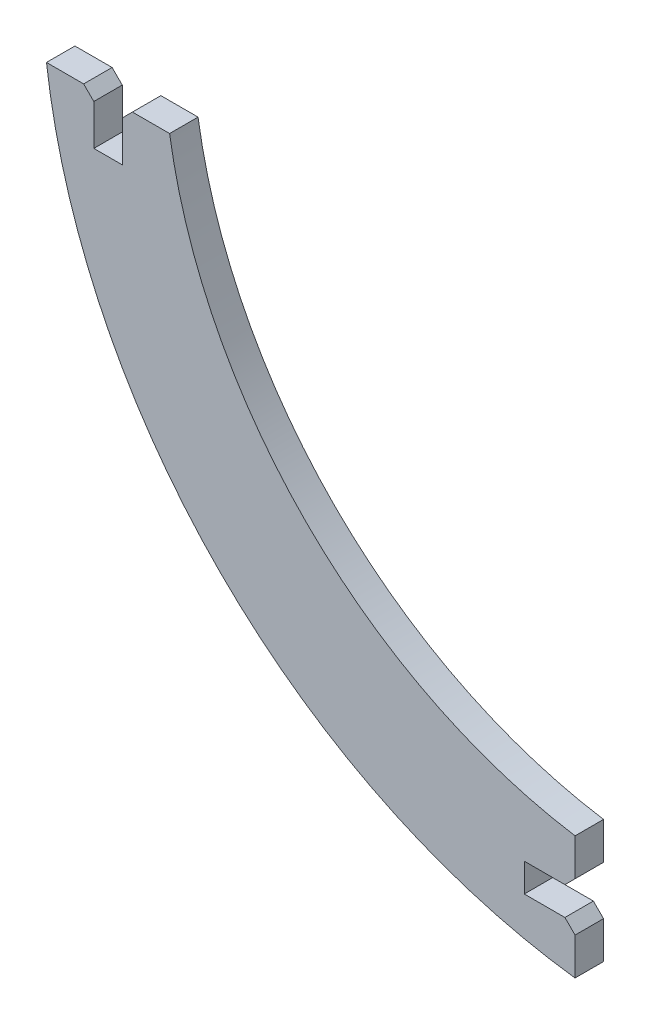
from build123d import *

# Parameters (mm, degrees)
SKETCH2_R           = 60
SKETCH2_R_2         = 48
BOSS_EXTRUDE1_DEPTH = 1.4
SKETCH3_W           = 12.589558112
SKETCH3_H           = 15
SKETCH3_W_2         = 15
SKETCH3_H_2         = 12.589558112
CUT_EXTRUDE1_DEPTH  = 2.8
SKETCH4_W           = 2.8
SKETCH4_H           = 5
SKETCH4_W_2         = 5
SKETCH4_H_2         = 2.8
CUT_EXTRUDE2_DEPTH  = 2.8
SKETCH5_W           = 35
SKETCH5_H           = 35
BOSS_EXTRUDE2_DEPTH = 2.8
SKETCH6_W           = 2.8
SKETCH6_H           = 5
CUT_EXTRUDE3_DEPTH  = 2.8
CIRPATTERN1_COUNT   = 4
FILLET1_R           = 12
CHAMFER2_SIZE       = 1
CHAMFER3_SIZE       = 1


with BuildPart() as part:
    # Sketch2 → Boss-Extrude1 (new, symmetric)
    with BuildSketch(Plane.XY):
        Circle(SKETCH2_R)
        Circle(SKETCH2_R_2, mode=Mode.SUBTRACT)
    extrude(amount=BOSS_EXTRUDE1_DEPTH, both=True)

    # Sketch3 → Cut-Extrude1 (cut)
    with BuildSketch(Plane.XY.offset(1.4)):
        with Locations((-53.705220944, 0)):
            Rectangle(SKETCH3_W, SKETCH3_H)
        with Locations((0, 53.705220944)):
            Rectangle(SKETCH3_W_2, SKETCH3_H_2)
        with Locations((53.705220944, 0)):
            Rectangle(SKETCH3_W, SKETCH3_H)
        with Locations((0, -53.705220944)):
            Rectangle(SKETCH3_W_2, SKETCH3_H_2)
    extrude(amount=-CUT_EXTRUDE1_DEPTH, mode=Mode.SUBTRACT)


with BuildPart() as cut_extrude1_piece_1:
    # of the separate pieces the step leaves, piece 1, a body of its own (cut_extrude1_pieces)
    add(part.part.solids().sort_by_distance((-59.529404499, -7.5, 1.4))[0])


with BuildPart() as cut_extrude1_piece_2:
    # of the separate pieces the step leaves, piece 2, a body of its own (cut_extrude1_pieces)
    add(part.part.solids().sort_by_distance((7.5, -59.529404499, -1.4))[0])


with BuildPart() as cut_extrude1_piece_3:
    # of the separate pieces the step leaves, piece 3, a body of its own (cut_extrude1_pieces)
    add(part.part.solids().sort_by_distance((59.529404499, 7.5, -1.4))[0])


with BuildPart() as cut_extrude1_piece_4:
    # of the separate pieces the step leaves, piece 4, a body of its own (cut_extrude1_pieces)
    add(part.part.solids().sort_by_distance((-7.5, 47.410441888, 1.4))[0])


with BuildPart() as cut_extrude2_tool:
    # Sketch4 → Cut-Extrude2 (new body)
    with BuildSketch(Plane.XY.offset(1.4)):
        with Locations((-53.469923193, 10)):
            Rectangle(SKETCH4_W, SKETCH4_H)
        with Locations((-10, 53.469923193)):
            Rectangle(SKETCH4_W_2, SKETCH4_H_2)
        with Locations((-10, -53.469923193)):
            Rectangle(SKETCH4_W_2, SKETCH4_H_2)
        with Locations((-53.469923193, -10)):
            Rectangle(SKETCH4_W, SKETCH4_H)
        with Locations((53.469923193, -10)):
            Rectangle(SKETCH4_W, SKETCH4_H)
        with Locations((10, -53.469923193)):
            Rectangle(SKETCH4_W_2, SKETCH4_H_2)
        with Locations((10, 53.469923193)):
            Rectangle(SKETCH4_W_2, SKETCH4_H_2)
        with Locations((53.469923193, 10)):
            Rectangle(SKETCH4_W, SKETCH4_H)
    extrude(amount=-CUT_EXTRUDE2_DEPTH)


with BuildPart() as cut_extrude1_piece_1_1:
    add(cut_extrude1_piece_1.part)

    # Cut-Extrude2: cut by cut_extrude2_tool
    add(cut_extrude2_tool.part, mode=Mode.SUBTRACT)

    # Chamfer3
    chamfer3_edges = [cut_extrude1_piece_1_1.edges().sort_by_distance(p)[0] for p in [
        (-7.5, -52.069923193, 0),
        (-7.5, -54.869923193, 0),
        (-54.869923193, -7.5, 0),
        (-52.069923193, -7.5, 0),
    ]]
    chamfer(chamfer3_edges, length=CHAMFER3_SIZE)


with BuildPart() as cut_extrude1_piece_2_1:
    add(cut_extrude1_piece_2.part)

    # Cut-Extrude2: cut by cut_extrude2_tool
    add(cut_extrude2_tool.part, mode=Mode.SUBTRACT)


with BuildPart() as cut_extrude1_piece_3_1:
    add(cut_extrude1_piece_3.part)

    # Cut-Extrude2: cut by cut_extrude2_tool
    add(cut_extrude2_tool.part, mode=Mode.SUBTRACT)


with BuildPart() as cut_extrude1_piece_4_1:
    add(cut_extrude1_piece_4.part)

    # Cut-Extrude2: cut by cut_extrude2_tool
    add(cut_extrude2_tool.part, mode=Mode.SUBTRACT)


with BuildPart() as body_5:
    # Sketch5 → Boss-Extrude2 (new body)
    with BuildSketch(Plane.ZY.offset(52.069923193)):
        Rectangle(SKETCH5_W, SKETCH5_H)
    extrude(amount=BOSS_EXTRUDE2_DEPTH)

    # Sketch6 → Cut-Extrude3 (cut)
    with BuildSketch(Plane.ZY.offset(54.869923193)):
        with Locations((0, 15)):
            Rectangle(SKETCH6_W, SKETCH6_H)
    cut_extrude3 = extrude(amount=-CUT_EXTRUDE3_DEPTH, mode=Mode.SUBTRACT)

    # CirPattern1: Cut-Extrude3 ×4 about axis
    cirpattern1_axis = Axis((0, 0, 0), (1, 0, 0))
    for i in range(1, CIRPATTERN1_COUNT):
        add(cut_extrude3.rotate(cirpattern1_axis, i * 360 / CIRPATTERN1_COUNT), mode=Mode.SUBTRACT)

    # Fillet1
    fillet1_edges = [body_5.edges().sort_by_distance(p)[0] for p in [
        (-53.469923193, 17.5, -17.5),
        (-53.469923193, -17.5, -17.5),
        (-53.469923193, -17.5, 17.5),
        (-53.469923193, 17.5, 17.5),
    ]]
    fillet(fillet1_edges, radius=FILLET1_R)

    # Chamfer2
    chamfer2_edges = [body_5.edges().sort_by_distance(p)[0] for p in [
        (-53.469923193, 17.5, 1.4),
        (-53.469923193, 17.5, -1.4),
        (-53.469923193, 1.4, 17.5),
        (-53.469923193, -1.4, 17.5),
        (-53.469923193, -17.5, 1.4),
        (-53.469923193, -17.5, -1.4),
        (-53.469923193, -1.4, -17.5),
        (-53.469923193, 1.4, -17.5),
    ]]
    chamfer(chamfer2_edges, length=CHAMFER2_SIZE)


with BuildPart() as cut_extrude1_piece_1_2:
    # Body-Move_Copy1: moved
    add(cut_extrude1_piece_1_1.part.moved(Location((0, -16, 0))))


solid = cut_extrude1_piece_1_2.part
